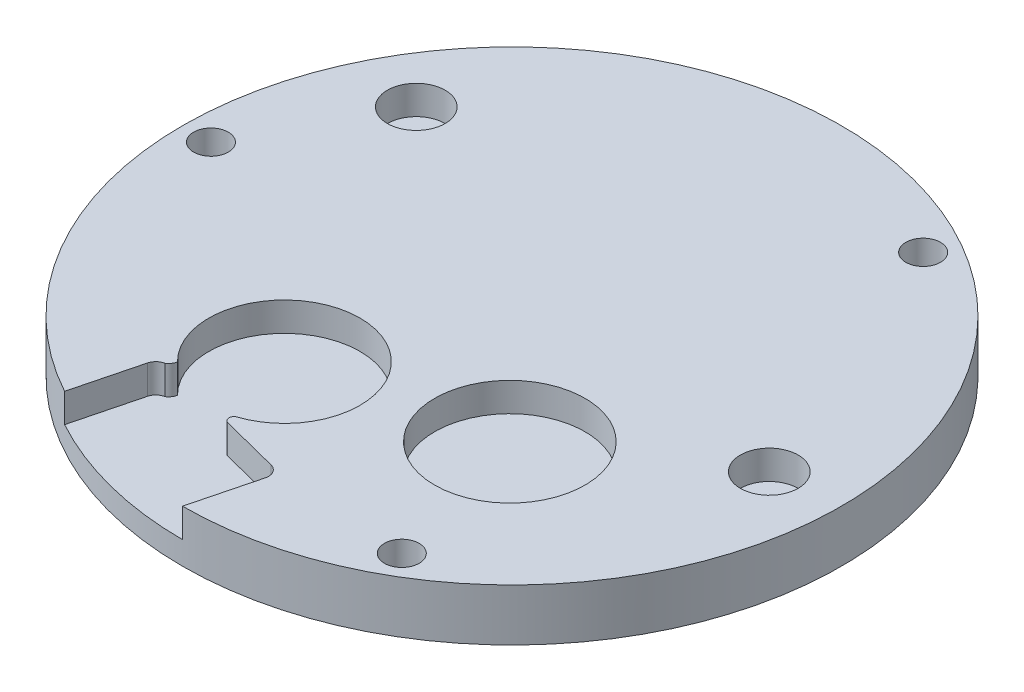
from build123d import *

# Parameters (mm, degrees)
BASE_SKETCH_R            = 57
MAIN_BODY_DEPTH          = 9
TRIPOD_HOLE_R            = 4.75
TRIPOD_HOLE_R_2          = 3.345362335
CUT_TRIPOD_HOLE_DEPTH    = 8
CLEAR_START              = -5
OUTCROPPINGS_R           = 5
CLEAR_OUTCROPPINGS_DEPTH = 5
SCREW_PATTERN_R          = 3
CUT_SCREW_HOLES_DEPTH    = 8
RUBBER_GROMMETS_R        = 13.080374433
RUBBER_GROMMETS_R_2      = 13.006771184
CUT_GROMMETS_DEPTH       = 5
DEPOINTIFY_DEPTH         = 5


with BuildPart() as part:
    # Base Sketch → Main Body (new body)
    with BuildSketch(Plane(origin=(0, 0, 0), x_dir=(1, 0, 0), z_dir=(0, 1, 0))):
        with Locations(Location((0, 0, 0), (0, 0, 270))):
            Circle(BASE_SKETCH_R)
    extrude(amount=MAIN_BODY_DEPTH)

    # Tripod Hole → Cut Tripod Hole (cut)
    with BuildSketch(Plane(origin=(0, 0, 0), x_dir=(-1, 0, 0), z_dir=(0, -1, 0))):
        with Locations(Location((0, 0, 0), (0, 0, 90))):
            Circle(TRIPOD_HOLE_R)
        with Locations(Location((0, 13.528335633, 0), (0, 0, 90))):
            Circle(TRIPOD_HOLE_R_2)
    extrude(amount=-CUT_TRIPOD_HOLE_DEPTH, mode=Mode.SUBTRACT)

    # Outcroppings → Clear outcroppings (cut)
    with BuildSketch(Plane(origin=(0, 9, 0), x_dir=(1, 0, 0), z_dir=(0, 1, 0)).offset(CLEAR_START)):
        with Locations(Location((45.58406059, -1.0813737, 0), (0, 0, 270))):
            Circle(OUTCROPPINGS_R)
        with Locations(Location((-39.594913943, 23.041578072, 0), (0, 0, 270))):
            Circle(OUTCROPPINGS_R)
        with BuildLine():
            Line((1.482498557, -43.153117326), (-22.047056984, -37.125686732))
            ThreePointArc((-22.047056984, -37.125686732), (-23.562399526, -37.342210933), (-24.480802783, -38.566825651))
            Line((-24.480802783, -38.566825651), (-27.404440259, -49.979962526))
            ThreePointArc((-27.404440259, -49.979962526), (-14.144648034, -55.21710724), (0, -57))
            Line((0, -57), (2.923637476, -45.586863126))
            ThreePointArc((2.923637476, -45.586863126), (2.707113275, -44.071520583), (1.482498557, -43.153117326))
        make_face()
    extrude(amount=CLEAR_OUTCROPPINGS_DEPTH, mode=Mode.SUBTRACT)

    # Screw Pattern → Cut Screw Holes (cut)
    with BuildSketch(Plane(origin=(0, 9, 0), x_dir=(1, 0, 0), z_dir=(0, 1, 0))):
        with Locations(Location((-52.068765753, 0, 0), (0, 0, 270))):
            Circle(SCREW_PATTERN_R)
        with Locations(Location((26.034382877, 45.092873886, 0), (0, 0, 270))):
            Circle(SCREW_PATTERN_R)
        with Locations(Location((26.034382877, -45.092873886, 0), (0, 0, 270))):
            Circle(SCREW_PATTERN_R)
    extrude(amount=-CUT_SCREW_HOLES_DEPTH, mode=Mode.SUBTRACT)

    # Rubber Grommets → Cut Grommets (cut)
    with BuildSketch(Plane(origin=(0, 9, 0), x_dir=(1, 0, 0), z_dir=(0, 1, 0))):
        with Locations((-12.824429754, -26.53769247)):
            Circle(RUBBER_GROMMETS_R)
        with Locations(Location((18.658444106, -19.02768238, 0), (0, 0, 270))):
            Circle(RUBBER_GROMMETS_R_2)
    extrude(amount=-CUT_GROMMETS_DEPTH, mode=Mode.SUBTRACT)

    # Clean up pointy spots → Depointify (cut)
    with BuildSketch(Plane(origin=(0, 9, 0), x_dir=(1, 0, 0), z_dir=(0, 1, 0))):
        with BuildLine():
            Line((-8.443615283, -40.610401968), (-10.58286789, -44.356386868))
            Line((-10.58286789, -44.356386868), (-23.226764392, -41.574547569))
            Line((-23.226764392, -41.574547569), (-23.562399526, -37.342210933))
            ThreePointArc((-23.562399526, -37.342210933), (-22.564518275, -36.816552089), (-22.045034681, -35.815442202))
            Line((-22.045034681, -35.815442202), (-19.445764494, -34.327307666))
            Line((-19.445764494, -34.327307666), (-8.330641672, -36.772794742))
            Line((-8.330641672, -36.772794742), (-8.443615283, -38.862653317))
            ThreePointArc((-8.443615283, -38.862653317), (-9.211788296, -39.736527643), (-8.443615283, -40.610401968))
        make_face()
    extrude(amount=-DEPOINTIFY_DEPTH, mode=Mode.SUBTRACT)


solid = part.part
